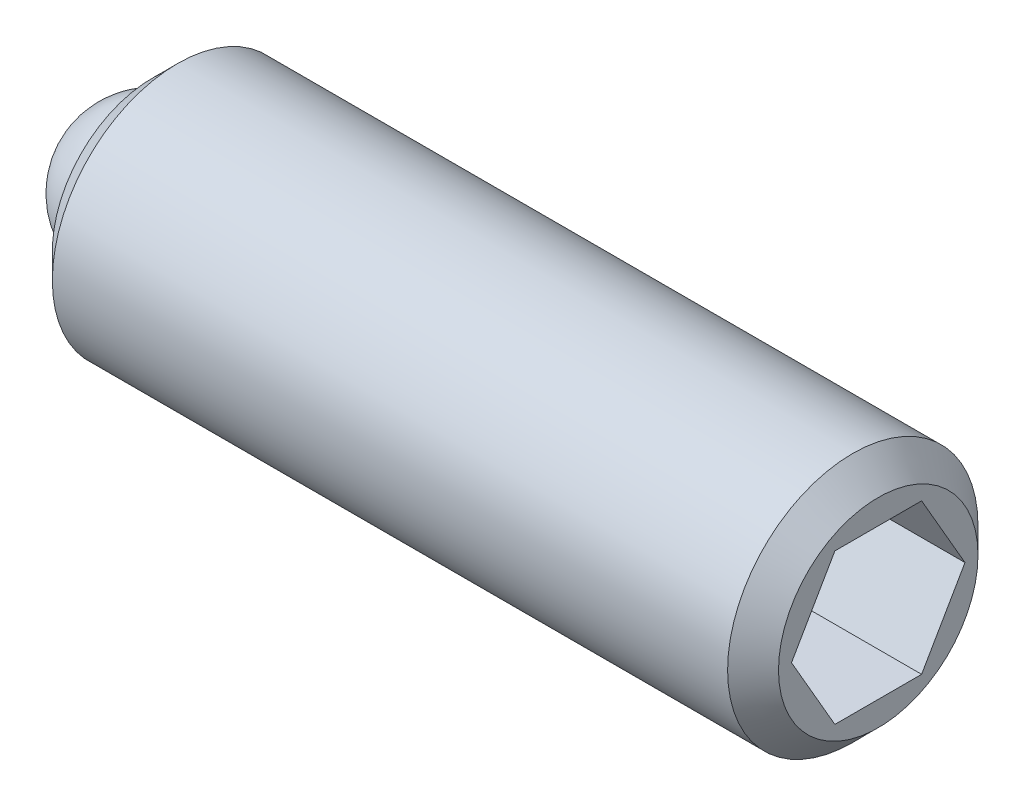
ISO-10303-21;
HEADER;
FILE_DESCRIPTION(('STEP AP214'),'2;1');
FILE_NAME('part.step','',(''),(''),'','','');
FILE_SCHEMA(('AUTOMOTIVE_DESIGN { 1 0 10303 214 1 1 1 1 }'));
ENDSEC;
DATA;
#1=APPLICATION_CONTEXT('core data for automotive mechanical design processes');
#2=APPLICATION_PROTOCOL_DEFINITION('international standard','automotive_design',2000,#1);
#3=PRODUCT_CONTEXT('',#1,'mechanical');
#4=PRODUCT('Part','Part','',(#3));
#5=PRODUCT_RELATED_PRODUCT_CATEGORY('part','',(#4));
#6=PRODUCT_DEFINITION_FORMATION('','',#4);
#7=PRODUCT_DEFINITION_CONTEXT('part definition',#1,'design');
#8=PRODUCT_DEFINITION('design','',#6,#7);
#9=PRODUCT_DEFINITION_SHAPE('','',#8);
#10=(LENGTH_UNIT() NAMED_UNIT(*) SI_UNIT(.MILLI.,.METRE.));
#11=(NAMED_UNIT(*) PLANE_ANGLE_UNIT() SI_UNIT($,.RADIAN.));
#12=(NAMED_UNIT(*) SI_UNIT($,.STERADIAN.) SOLID_ANGLE_UNIT());
#13=UNCERTAINTY_MEASURE_WITH_UNIT(LENGTH_MEASURE(1.E-05),#10,'distance_accuracy_value','');
#14=(GEOMETRIC_REPRESENTATION_CONTEXT(3) GLOBAL_UNCERTAINTY_ASSIGNED_CONTEXT((#13)) GLOBAL_UNIT_ASSIGNED_CONTEXT((#10,
#11,#12)) REPRESENTATION_CONTEXT('',''));
#15=CARTESIAN_POINT('',(0.,0.,0.));
#16=DIRECTION('',(0.,0.,1.));
#17=DIRECTION('',(1.,0.,0.));
#18=AXIS2_PLACEMENT_3D('',#15,#16,#17);
#19=CARTESIAN_POINT('',(0.,0.,0.));
#20=DIRECTION('',(0.,-1.,0.));
#21=DIRECTION('',(0.,0.,-1.));
#22=AXIS2_PLACEMENT_3D('',#19,#20,#21);
#23=SPHERICAL_SURFACE('',#22,0.75);
#24=CARTESIAN_POINT('',(0.,-0.75,0.));
#25=VERTEX_POINT('',#24);
#26=VERTEX_LOOP('',#25);
#27=FACE_BOUND('',#26,.T.);
#28=ADVANCED_FACE('F43',(#27),#23,.T.);
#29=CLOSED_SHELL('',(#28));
#30=MANIFOLD_SOLID_BREP('B2',#29);
#31=CARTESIAN_POINT('',(7.25,0.,0.));
#32=DIRECTION('',(-1.,0.,0.));
#33=DIRECTION('',(0.,0.,1.));
#34=AXIS2_PLACEMENT_3D('',#31,#32,#33);
#35=CYLINDRICAL_SURFACE('',#34,1.25);
#36=CARTESIAN_POINT('',(6.996,0.,0.));
#37=DIRECTION('',(1.,0.,0.));
#38=DIRECTION('',(0.,0.,-1.));
#39=AXIS2_PLACEMENT_3D('',#36,#37,#38);
#40=CIRCLE('',#39,1.25);
#41=CARTESIAN_POINT('',(6.996,0.,1.25));
#42=VERTEX_POINT('',#41);
#43=EDGE_CURVE('E41',#42,#42,#40,.F.);
#44=CARTESIAN_POINT('',(0.254000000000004,0.,0.));
#45=DIRECTION('',(1.,0.,0.));
#46=DIRECTION('',(0.,0.,-1.));
#47=AXIS2_PLACEMENT_3D('',#44,#45,#46);
#48=CIRCLE('',#47,1.25);
#49=CARTESIAN_POINT('',(0.254000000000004,0.,1.25));
#50=VERTEX_POINT('',#49);
#51=EDGE_CURVE('E159',#50,#50,#48,.T.);
#52=CARTESIAN_POINT('',(6.996,0.,1.25));
#53=CARTESIAN_POINT('',(6.92577083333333,0.,1.25));
#54=CARTESIAN_POINT('',(6.85554166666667,0.,1.25));
#55=CARTESIAN_POINT('',(6.71508333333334,0.,1.25));
#56=CARTESIAN_POINT('',(6.64485416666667,0.,1.25));
#57=CARTESIAN_POINT('',(6.50439583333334,0.,1.25));
#58=CARTESIAN_POINT('',(6.43416666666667,0.,1.25));
#59=CARTESIAN_POINT('',(6.29370833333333,0.,1.25));
#60=CARTESIAN_POINT('',(6.22347916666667,0.,1.25));
#61=CARTESIAN_POINT('',(6.08302083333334,0.,1.25));
#62=CARTESIAN_POINT('',(6.01279166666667,0.,1.25));
#63=CARTESIAN_POINT('',(5.87233333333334,0.,1.25));
#64=CARTESIAN_POINT('',(5.80210416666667,0.,1.25));
#65=CARTESIAN_POINT('',(5.66164583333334,0.,1.25));
#66=CARTESIAN_POINT('',(5.59141666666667,0.,1.25));
#67=CARTESIAN_POINT('',(5.45095833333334,0.,1.25));
#68=CARTESIAN_POINT('',(5.38072916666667,0.,1.25));
#69=CARTESIAN_POINT('',(5.24027083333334,0.,1.25));
#70=CARTESIAN_POINT('',(5.17004166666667,0.,1.25));
#71=CARTESIAN_POINT('',(5.02958333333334,0.,1.25));
#72=CARTESIAN_POINT('',(4.95935416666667,0.,1.25));
#73=CARTESIAN_POINT('',(4.81889583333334,0.,1.25));
#74=CARTESIAN_POINT('',(4.74866666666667,0.,1.25));
#75=CARTESIAN_POINT('',(4.60820833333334,0.,1.25));
#76=CARTESIAN_POINT('',(4.53797916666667,0.,1.25));
#77=CARTESIAN_POINT('',(4.39752083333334,0.,1.25));
#78=CARTESIAN_POINT('',(4.32729166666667,0.,1.25));
#79=CARTESIAN_POINT('',(4.18683333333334,0.,1.25));
#80=CARTESIAN_POINT('',(4.11660416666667,0.,1.25));
#81=CARTESIAN_POINT('',(3.97614583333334,0.,1.25));
#82=CARTESIAN_POINT('',(3.90591666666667,0.,1.25));
#83=CARTESIAN_POINT('',(3.76545833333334,0.,1.25));
#84=CARTESIAN_POINT('',(3.69522916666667,0.,1.25));
#85=CARTESIAN_POINT('',(3.55477083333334,0.,1.25));
#86=CARTESIAN_POINT('',(3.48454166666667,0.,1.25));
#87=CARTESIAN_POINT('',(3.34408333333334,0.,1.25));
#88=CARTESIAN_POINT('',(3.27385416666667,0.,1.25));
#89=CARTESIAN_POINT('',(3.13339583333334,0.,1.25));
#90=CARTESIAN_POINT('',(3.06316666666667,0.,1.25));
#91=CARTESIAN_POINT('',(2.92270833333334,0.,1.25));
#92=CARTESIAN_POINT('',(2.85247916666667,0.,1.25));
#93=CARTESIAN_POINT('',(2.71202083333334,0.,1.25));
#94=CARTESIAN_POINT('',(2.64179166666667,0.,1.25));
#95=CARTESIAN_POINT('',(2.50133333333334,0.,1.25));
#96=CARTESIAN_POINT('',(2.43110416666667,0.,1.25));
#97=CARTESIAN_POINT('',(2.29064583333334,0.,1.25));
#98=CARTESIAN_POINT('',(2.22041666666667,0.,1.25));
#99=CARTESIAN_POINT('',(2.07995833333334,0.,1.25));
#100=CARTESIAN_POINT('',(2.00972916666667,0.,1.25));
#101=CARTESIAN_POINT('',(1.86927083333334,0.,1.25));
#102=CARTESIAN_POINT('',(1.79904166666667,0.,1.25));
#103=CARTESIAN_POINT('',(1.65858333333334,0.,1.25));
#104=CARTESIAN_POINT('',(1.58835416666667,0.,1.25));
#105=CARTESIAN_POINT('',(1.44789583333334,0.,1.25));
#106=CARTESIAN_POINT('',(1.37766666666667,0.,1.25));
#107=CARTESIAN_POINT('',(1.23720833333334,0.,1.25));
#108=CARTESIAN_POINT('',(1.16697916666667,0.,1.25));
#109=CARTESIAN_POINT('',(1.02652083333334,0.,1.25));
#110=CARTESIAN_POINT('',(0.956291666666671,0.,1.25));
#111=CARTESIAN_POINT('',(0.815833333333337,0.,1.25));
#112=CARTESIAN_POINT('',(0.745604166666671,0.,1.25));
#113=CARTESIAN_POINT('',(0.605145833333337,0.,1.25));
#114=CARTESIAN_POINT('',(0.534916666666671,0.,1.25));
#115=CARTESIAN_POINT('',(0.394458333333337,0.,1.25));
#116=CARTESIAN_POINT('',(0.324229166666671,0.,1.25));
#117=CARTESIAN_POINT('',(0.254000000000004,0.,1.25));
#118=B_SPLINE_CURVE_WITH_KNOTS('',3,(#52,#53,#54,#55,#56,#57,#58,#59,#60,#61,#62,#63,#64,#65,
#66,#67,#68,#69,#70,#71,#72,#73,#74,#75,#76,#77,#78,#79,#80,#81,#82,#83,#84,#85,#86,#87,#88,#89,
#90,#91,#92,#93,#94,#95,#96,#97,#98,#99,#100,#101,#102,#103,#104,#105,#106,#107,#108,#109,#110,
#111,#112,#113,#114,#115,#116,#117),.UNSPECIFIED.,.F.,.F.,(4,2,2,2,2,2,2,2,2,2,2,2,2,2,2,2,2,2,
2,2,2,2,2,2,2,2,2,2,2,2,2,2,4),(0.,0.2106875,0.421374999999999,0.6320625,0.842749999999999,
1.0534375,1.264125,1.4748125,1.6855,1.8961875,2.106875,2.3175625,2.52825,2.7389375,2.949625,
3.1603125,3.371,3.5816875,3.792375,4.0030625,4.21375,4.4244375,4.635125,4.8458125,5.0565,
5.2671875,5.477875,5.6885625,5.89925,6.1099375,6.320625,6.5313125,6.742),.UNSPECIFIED.);
#119=EDGE_CURVE('BSEAM56',#42,#50,#118,.T.);
#120=ORIENTED_EDGE('',*,*,#43,.T.);
#121=ORIENTED_EDGE('',*,*,#51,.T.);
#122=ORIENTED_EDGE('',*,*,#119,.T.);
#123=ORIENTED_EDGE('',*,*,#119,.F.);
#124=EDGE_LOOP('',(#120,#122,#121,#123));
#125=FACE_BOUND('',#124,.T.);
#126=ADVANCED_FACE('F56',(#125),#35,.T.);
#127=CARTESIAN_POINT('',(7.25,0.,0.));
#128=DIRECTION('',(1.,0.,0.));
#129=DIRECTION('',(0.,0.,-1.));
#130=AXIS2_PLACEMENT_3D('',#127,#128,#129);
#131=PLANE('',#130);
#132=DIRECTION('',(0.,0.866025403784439,-0.5));
#133=VECTOR('',#132,1.);
#134=CARTESIAN_POINT('',(7.25,-0.75,-0.43301270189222));
#135=LINE('',#134,#133);
#136=CARTESIAN_POINT('',(7.25,-0.75,-0.43301270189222));
#137=VERTEX_POINT('',#136);
#138=CARTESIAN_POINT('',(7.25,0.,-0.866025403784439));
#139=VERTEX_POINT('',#138);
#140=EDGE_CURVE('E71',#137,#139,#135,.T.);
#141=ORIENTED_EDGE('',*,*,#140,.F.);
#142=DIRECTION('',(0.,0.,-1.));
#143=VECTOR('',#142,1.);
#144=CARTESIAN_POINT('',(7.25,-0.75,0.433012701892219));
#145=LINE('',#144,#143);
#146=CARTESIAN_POINT('',(7.25,-0.75,0.433012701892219));
#147=VERTEX_POINT('',#146);
#148=EDGE_CURVE('E155',#147,#137,#145,.T.);
#149=ORIENTED_EDGE('',*,*,#148,.F.);
#150=DIRECTION('',(0.,-0.866025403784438,-0.5));
#151=VECTOR('',#150,1.);
#152=CARTESIAN_POINT('',(7.25,0.,0.866025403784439));
#153=LINE('',#152,#151);
#154=CARTESIAN_POINT('',(7.25,0.,0.866025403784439));
#155=VERTEX_POINT('',#154);
#156=EDGE_CURVE('E153',#155,#147,#153,.T.);
#157=ORIENTED_EDGE('',*,*,#156,.F.);
#158=DIRECTION('',(0.,-0.866025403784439,0.5));
#159=VECTOR('',#158,1.);
#160=CARTESIAN_POINT('',(7.25,0.75,0.433012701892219));
#161=LINE('',#160,#159);
#162=CARTESIAN_POINT('',(7.25,0.75,0.433012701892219));
#163=VERTEX_POINT('',#162);
#164=EDGE_CURVE('E119',#163,#155,#161,.T.);
#165=ORIENTED_EDGE('',*,*,#164,.F.);
#166=DIRECTION('',(0.,0.,1.));
#167=VECTOR('',#166,1.);
#168=CARTESIAN_POINT('',(7.25,0.75,-0.433012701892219));
#169=LINE('',#168,#167);
#170=CARTESIAN_POINT('',(7.25,0.75,-0.433012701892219));
#171=VERTEX_POINT('',#170);
#172=EDGE_CURVE('E149',#171,#163,#169,.T.);
#173=ORIENTED_EDGE('',*,*,#172,.F.);
#174=DIRECTION('',(0.,0.866025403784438,0.5));
#175=VECTOR('',#174,1.);
#176=CARTESIAN_POINT('',(7.25,0.,-0.866025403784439));
#177=LINE('',#176,#175);
#178=EDGE_CURVE('E145',#139,#171,#177,.T.);
#179=ORIENTED_EDGE('',*,*,#178,.F.);
#180=EDGE_LOOP('',(#141,#149,#157,#165,#173,#179));
#181=FACE_BOUND('',#180,.T.);
#182=CARTESIAN_POINT('',(7.25,0.,0.));
#183=DIRECTION('',(1.,0.,0.));
#184=DIRECTION('',(0.,0.,-1.));
#185=AXIS2_PLACEMENT_3D('',#182,#183,#184);
#186=CIRCLE('',#185,0.996000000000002);
#187=CARTESIAN_POINT('',(7.25,0.,-0.996000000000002));
#188=VERTEX_POINT('',#187);
#189=EDGE_CURVE('E64',#188,#188,#186,.T.);
#190=ORIENTED_EDGE('',*,*,#189,.T.);
#191=EDGE_LOOP('',(#190));
#192=FACE_BOUND('',#191,.T.);
#193=ADVANCED_FACE('F172',(#181,#192),#131,.T.);
#194=CARTESIAN_POINT('',(0.,0.,0.));
#195=DIRECTION('',(1.,0.,0.));
#196=DIRECTION('',(0.,0.,-1.));
#197=AXIS2_PLACEMENT_3D('',#194,#195,#196);
#198=PLANE('',#197);
#199=CARTESIAN_POINT('',(0.,0.,0.));
#200=DIRECTION('',(-1.,0.,0.));
#201=DIRECTION('',(0.,0.,1.));
#202=AXIS2_PLACEMENT_3D('',#199,#200,#201);
#203=CIRCLE('',#202,0.75);
#204=CARTESIAN_POINT('',(0.,0.,0.75));
#205=VERTEX_POINT('',#204);
#206=EDGE_CURVE('E227',#205,#205,#203,.T.);
#207=ORIENTED_EDGE('',*,*,#206,.F.);
#208=EDGE_LOOP('',(#207));
#209=FACE_BOUND('',#208,.T.);
#210=CARTESIAN_POINT('',(0.,0.,0.));
#211=DIRECTION('',(1.,0.,0.));
#212=DIRECTION('',(0.,0.,-1.));
#213=AXIS2_PLACEMENT_3D('',#210,#211,#212);
#214=CIRCLE('',#213,0.995999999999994);
#215=CARTESIAN_POINT('',(0.,0.,-0.995999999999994));
#216=VERTEX_POINT('',#215);
#217=EDGE_CURVE('E167',#216,#216,#214,.F.);
#218=ORIENTED_EDGE('',*,*,#217,.T.);
#219=EDGE_LOOP('',(#218));
#220=FACE_BOUND('',#219,.T.);
#221=ADVANCED_FACE('F184',(#209,#220),#198,.F.);
#222=CARTESIAN_POINT('',(0.254000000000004,0.,0.));
#223=DIRECTION('',(1.,0.,0.));
#224=DIRECTION('',(0.,0.,-1.));
#225=AXIS2_PLACEMENT_3D('',#222,#223,#224);
#226=CONICAL_SURFACE('',#225,1.25,0.785398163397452);
#227=ORIENTED_EDGE('',*,*,#217,.F.);
#228=EDGE_LOOP('',(#227));
#229=FACE_BOUND('',#228,.T.);
#230=ORIENTED_EDGE('',*,*,#51,.F.);
#231=EDGE_LOOP('',(#230));
#232=FACE_BOUND('',#231,.T.);
#233=ADVANCED_FACE('F176',(#229,#232),#226,.T.);
#234=CARTESIAN_POINT('',(7.25,0.,0.));
#235=DIRECTION('',(-1.,0.,0.));
#236=DIRECTION('',(0.,0.,1.));
#237=AXIS2_PLACEMENT_3D('',#234,#235,#236);
#238=CONICAL_SURFACE('',#237,0.996000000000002,0.785398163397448);
#239=ORIENTED_EDGE('',*,*,#43,.F.);
#240=EDGE_LOOP('',(#239));
#241=FACE_BOUND('',#240,.T.);
#242=ORIENTED_EDGE('',*,*,#189,.F.);
#243=EDGE_LOOP('',(#242));
#244=FACE_BOUND('',#243,.T.);
#245=ADVANCED_FACE('F58',(#241,#244),#238,.T.);
#246=CARTESIAN_POINT('',(5.25,-0.75,-0.43301270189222));
#247=DIRECTION('',(0.,-0.5,-0.866025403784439));
#248=DIRECTION('',(0.,0.866025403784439,-0.5));
#249=AXIS2_PLACEMENT_3D('',#246,#247,#248);
#250=PLANE('',#249);
#251=ORIENTED_EDGE('',*,*,#140,.T.);
#252=DIRECTION('',(1.,0.,0.));
#253=VECTOR('',#252,1.);
#254=CARTESIAN_POINT('',(5.25,0.,-0.866025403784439));
#255=LINE('',#254,#253);
#256=CARTESIAN_POINT('',(5.25,0.,-0.866025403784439));
#257=VERTEX_POINT('',#256);
#258=EDGE_CURVE('E101',#257,#139,#255,.T.);
#259=ORIENTED_EDGE('',*,*,#258,.F.);
#260=DIRECTION('',(0.,0.866025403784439,-0.5));
#261=VECTOR('',#260,1.);
#262=CARTESIAN_POINT('',(5.25,-0.75,-0.43301270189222));
#263=LINE('',#262,#261);
#264=CARTESIAN_POINT('',(5.25,-0.75,-0.43301270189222));
#265=VERTEX_POINT('',#264);
#266=EDGE_CURVE('E157',#265,#257,#263,.T.);
#267=ORIENTED_EDGE('',*,*,#266,.F.);
#268=DIRECTION('',(1.,0.,0.));
#269=VECTOR('',#268,1.);
#270=CARTESIAN_POINT('',(5.25,-0.75,-0.43301270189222));
#271=LINE('',#270,#269);
#272=EDGE_CURVE('E79',#265,#137,#271,.T.);
#273=ORIENTED_EDGE('',*,*,#272,.T.);
#274=EDGE_LOOP('',(#251,#259,#267,#273));
#275=FACE_BOUND('',#274,.T.);
#276=ADVANCED_FACE('F175',(#275),#250,.F.);
#277=CARTESIAN_POINT('',(5.25,-0.75,0.433012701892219));
#278=DIRECTION('',(0.,-1.,0.));
#279=DIRECTION('',(0.,0.,-1.));
#280=AXIS2_PLACEMENT_3D('',#277,#278,#279);
#281=PLANE('',#280);
#282=ORIENTED_EDGE('',*,*,#148,.T.);
#283=ORIENTED_EDGE('',*,*,#272,.F.);
#284=DIRECTION('',(0.,0.,-1.));
#285=VECTOR('',#284,1.);
#286=CARTESIAN_POINT('',(5.25,-0.75,0.433012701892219));
#287=LINE('',#286,#285);
#288=CARTESIAN_POINT('',(5.25,-0.75,0.433012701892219));
#289=VERTEX_POINT('',#288);
#290=EDGE_CURVE('E131',#289,#265,#287,.T.);
#291=ORIENTED_EDGE('',*,*,#290,.F.);
#292=DIRECTION('',(1.,0.,0.));
#293=VECTOR('',#292,1.);
#294=CARTESIAN_POINT('',(5.25,-0.75,0.433012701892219));
#295=LINE('',#294,#293);
#296=EDGE_CURVE('E123',#289,#147,#295,.T.);
#297=ORIENTED_EDGE('',*,*,#296,.T.);
#298=EDGE_LOOP('',(#282,#283,#291,#297));
#299=FACE_BOUND('',#298,.T.);
#300=ADVANCED_FACE('F182',(#299),#281,.F.);
#301=CARTESIAN_POINT('',(5.25,0.,0.866025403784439));
#302=DIRECTION('',(0.,-0.5,0.866025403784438));
#303=DIRECTION('',(0.,-0.866025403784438,-0.5));
#304=AXIS2_PLACEMENT_3D('',#301,#302,#303);
#305=PLANE('',#304);
#306=ORIENTED_EDGE('',*,*,#156,.T.);
#307=ORIENTED_EDGE('',*,*,#296,.F.);
#308=DIRECTION('',(0.,-0.866025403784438,-0.5));
#309=VECTOR('',#308,1.);
#310=CARTESIAN_POINT('',(5.25,0.,0.866025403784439));
#311=LINE('',#310,#309);
#312=CARTESIAN_POINT('',(5.25,0.,0.866025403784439));
#313=VERTEX_POINT('',#312);
#314=EDGE_CURVE('E127',#313,#289,#311,.T.);
#315=ORIENTED_EDGE('',*,*,#314,.F.);
#316=DIRECTION('',(1.,0.,0.));
#317=VECTOR('',#316,1.);
#318=CARTESIAN_POINT('',(5.25,0.,0.866025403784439));
#319=LINE('',#318,#317);
#320=EDGE_CURVE('E112',#313,#155,#319,.T.);
#321=ORIENTED_EDGE('',*,*,#320,.T.);
#322=EDGE_LOOP('',(#306,#307,#315,#321));
#323=FACE_BOUND('',#322,.T.);
#324=ADVANCED_FACE('F128',(#323),#305,.F.);
#325=CARTESIAN_POINT('',(5.25,0.75,0.433012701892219));
#326=DIRECTION('',(0.,0.5,0.866025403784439));
#327=DIRECTION('',(0.,-0.866025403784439,0.5));
#328=AXIS2_PLACEMENT_3D('',#325,#326,#327);
#329=PLANE('',#328);
#330=ORIENTED_EDGE('',*,*,#164,.T.);
#331=ORIENTED_EDGE('',*,*,#320,.F.);
#332=DIRECTION('',(0.,-0.866025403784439,0.5));
#333=VECTOR('',#332,1.);
#334=CARTESIAN_POINT('',(5.25,0.75,0.433012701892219));
#335=LINE('',#334,#333);
#336=CARTESIAN_POINT('',(5.25,0.75,0.433012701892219));
#337=VERTEX_POINT('',#336);
#338=EDGE_CURVE('E116',#337,#313,#335,.T.);
#339=ORIENTED_EDGE('',*,*,#338,.F.);
#340=DIRECTION('',(1.,0.,0.));
#341=VECTOR('',#340,1.);
#342=CARTESIAN_POINT('',(5.25,0.75,0.433012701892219));
#343=LINE('',#342,#341);
#344=EDGE_CURVE('E124',#337,#163,#343,.T.);
#345=ORIENTED_EDGE('',*,*,#344,.T.);
#346=EDGE_LOOP('',(#330,#331,#339,#345));
#347=FACE_BOUND('',#346,.T.);
#348=ADVANCED_FACE('F114',(#347),#329,.F.);
#349=CARTESIAN_POINT('',(5.25,0.75,-0.433012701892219));
#350=DIRECTION('',(0.,1.,0.));
#351=DIRECTION('',(0.,0.,1.));
#352=AXIS2_PLACEMENT_3D('',#349,#350,#351);
#353=PLANE('',#352);
#354=ORIENTED_EDGE('',*,*,#172,.T.);
#355=ORIENTED_EDGE('',*,*,#344,.F.);
#356=DIRECTION('',(0.,0.,1.));
#357=VECTOR('',#356,1.);
#358=CARTESIAN_POINT('',(5.25,0.75,-0.433012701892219));
#359=LINE('',#358,#357);
#360=CARTESIAN_POINT('',(5.25,0.75,-0.433012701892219));
#361=VERTEX_POINT('',#360);
#362=EDGE_CURVE('E137',#361,#337,#359,.T.);
#363=ORIENTED_EDGE('',*,*,#362,.F.);
#364=DIRECTION('',(1.,0.,0.));
#365=VECTOR('',#364,1.);
#366=CARTESIAN_POINT('',(5.25,0.75,-0.433012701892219));
#367=LINE('',#366,#365);
#368=EDGE_CURVE('E162',#361,#171,#367,.T.);
#369=ORIENTED_EDGE('',*,*,#368,.T.);
#370=EDGE_LOOP('',(#354,#355,#363,#369));
#371=FACE_BOUND('',#370,.T.);
#372=ADVANCED_FACE('F203',(#371),#353,.F.);
#373=CARTESIAN_POINT('',(5.25,0.,-0.866025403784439));
#374=DIRECTION('',(0.,0.500000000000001,-0.866025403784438));
#375=DIRECTION('',(0.,0.866025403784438,0.500000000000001));
#376=AXIS2_PLACEMENT_3D('',#373,#374,#375);
#377=PLANE('',#376);
#378=ORIENTED_EDGE('',*,*,#178,.T.);
#379=ORIENTED_EDGE('',*,*,#368,.F.);
#380=DIRECTION('',(0.,0.866025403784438,0.5));
#381=VECTOR('',#380,1.);
#382=CARTESIAN_POINT('',(5.25,0.,-0.866025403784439));
#383=LINE('',#382,#381);
#384=EDGE_CURVE('E139',#257,#361,#383,.T.);
#385=ORIENTED_EDGE('',*,*,#384,.F.);
#386=ORIENTED_EDGE('',*,*,#258,.T.);
#387=EDGE_LOOP('',(#378,#379,#385,#386));
#388=FACE_BOUND('',#387,.T.);
#389=ADVANCED_FACE('F200',(#388),#377,.F.);
#390=CARTESIAN_POINT('',(5.25,0.,0.));
#391=DIRECTION('',(1.,0.,0.));
#392=DIRECTION('',(0.,0.,-1.));
#393=AXIS2_PLACEMENT_3D('',#390,#391,#392);
#394=PLANE('',#393);
#395=ORIENTED_EDGE('',*,*,#266,.T.);
#396=ORIENTED_EDGE('',*,*,#384,.T.);
#397=ORIENTED_EDGE('',*,*,#362,.T.);
#398=ORIENTED_EDGE('',*,*,#338,.T.);
#399=ORIENTED_EDGE('',*,*,#314,.T.);
#400=ORIENTED_EDGE('',*,*,#290,.T.);
#401=EDGE_LOOP('',(#395,#396,#397,#398,#399,#400));
#402=FACE_BOUND('',#401,.T.);
#403=ADVANCED_FACE('F134',(#402),#394,.T.);
#404=CARTESIAN_POINT('',(0.8,0.,0.));
#405=DIRECTION('',(-1.,0.,0.));
#406=DIRECTION('',(0.,0.,1.));
#407=AXIS2_PLACEMENT_3D('',#404,#405,#406);
#408=CYLINDRICAL_SURFACE('',#407,0.75);
#409=CARTESIAN_POINT('',(0.8,0.,0.));
#410=DIRECTION('',(-1.,0.,0.));
#411=DIRECTION('',(0.,0.,1.));
#412=AXIS2_PLACEMENT_3D('',#409,#410,#411);
#413=CIRCLE('',#412,0.75);
#414=CARTESIAN_POINT('',(0.8,0.,0.75));
#415=VERTEX_POINT('',#414);
#416=EDGE_CURVE('E146',#415,#415,#413,.T.);
#417=ORIENTED_EDGE('',*,*,#416,.F.);
#418=EDGE_LOOP('',(#417));
#419=FACE_BOUND('',#418,.T.);
#420=ORIENTED_EDGE('',*,*,#206,.T.);
#421=EDGE_LOOP('',(#420));
#422=FACE_BOUND('',#421,.T.);
#423=ADVANCED_FACE('F216',(#419,#422),#408,.F.);
#424=CARTESIAN_POINT('',(0.8,0.,0.));
#425=DIRECTION('',(-1.,0.,0.));
#426=DIRECTION('',(0.,0.,1.));
#427=AXIS2_PLACEMENT_3D('',#424,#425,#426);
#428=PLANE('',#427);
#429=ORIENTED_EDGE('',*,*,#416,.T.);
#430=EDGE_LOOP('',(#429));
#431=FACE_BOUND('',#430,.T.);
#432=ADVANCED_FACE('F219',(#431),#428,.T.);
#433=CLOSED_SHELL('',(#126,#193,#221,#233,#245,#276,#300,#324,#348,#372,#389,#403,#423,#432));
#434=MANIFOLD_SOLID_BREP('B6',#433);
#435=ADVANCED_BREP_SHAPE_REPRESENTATION('',(#18,#30,#434),#14);
#436=SHAPE_DEFINITION_REPRESENTATION(#9,#435);
ENDSEC;
END-ISO-10303-21;
